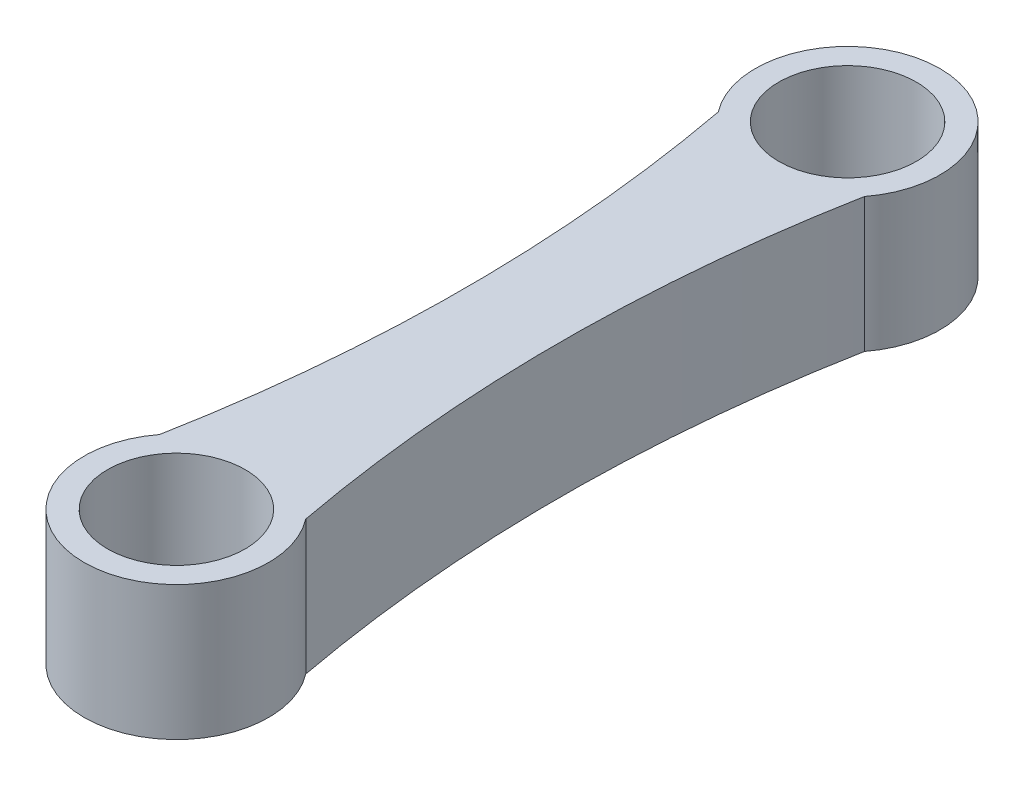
ISO-10303-21;
HEADER;
FILE_DESCRIPTION(('STEP AP214'),'2;1');
FILE_NAME('part.step','',(''),(''),'','','');
FILE_SCHEMA(('AUTOMOTIVE_DESIGN { 1 0 10303 214 1 1 1 1 }'));
ENDSEC;
DATA;
#1=APPLICATION_CONTEXT('core data for automotive mechanical design processes');
#2=APPLICATION_PROTOCOL_DEFINITION('international standard','automotive_design',2000,#1);
#3=PRODUCT_CONTEXT('',#1,'mechanical');
#4=PRODUCT('Part','Part','',(#3));
#5=PRODUCT_RELATED_PRODUCT_CATEGORY('part','',(#4));
#6=PRODUCT_DEFINITION_FORMATION('','',#4);
#7=PRODUCT_DEFINITION_CONTEXT('part definition',#1,'design');
#8=PRODUCT_DEFINITION('design','',#6,#7);
#9=PRODUCT_DEFINITION_SHAPE('','',#8);
#10=(LENGTH_UNIT() NAMED_UNIT(*) SI_UNIT(.MILLI.,.METRE.));
#11=(NAMED_UNIT(*) PLANE_ANGLE_UNIT() SI_UNIT($,.RADIAN.));
#12=(NAMED_UNIT(*) SI_UNIT($,.STERADIAN.) SOLID_ANGLE_UNIT());
#13=UNCERTAINTY_MEASURE_WITH_UNIT(LENGTH_MEASURE(1.E-05),#10,'distance_accuracy_value','');
#14=(GEOMETRIC_REPRESENTATION_CONTEXT(3) GLOBAL_UNCERTAINTY_ASSIGNED_CONTEXT((#13)) GLOBAL_UNIT_ASSIGNED_CONTEXT((#10,
#11,#12)) REPRESENTATION_CONTEXT('',''));
#15=CARTESIAN_POINT('',(0.,0.,0.));
#16=DIRECTION('',(0.,0.,1.));
#17=DIRECTION('',(1.,0.,0.));
#18=AXIS2_PLACEMENT_3D('',#15,#16,#17);
#19=CARTESIAN_POINT('',(0.,8.,16.8173598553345));
#20=DIRECTION('',(0.,-1.,0.));
#21=DIRECTION('',(0.,0.,-1.));
#22=AXIS2_PLACEMENT_3D('',#19,#20,#21);
#23=CYLINDRICAL_SURFACE('',#22,5.5);
#24=CARTESIAN_POINT('',(0.,0.,16.8173598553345));
#25=DIRECTION('',(0.,1.,0.));
#26=DIRECTION('',(0.,0.,1.));
#27=AXIS2_PLACEMENT_3D('',#24,#25,#26);
#28=CIRCLE('',#27,5.5);
#29=CARTESIAN_POINT('',(-4.35925472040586,0.,13.4637202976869));
#30=VERTEX_POINT('',#29);
#31=CARTESIAN_POINT('',(4.35925472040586,0.,13.4637202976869));
#32=VERTEX_POINT('',#31);
#33=EDGE_CURVE('E113',#30,#32,#28,.T.);
#34=ORIENTED_EDGE('',*,*,#33,.T.);
#35=DIRECTION('',(0.,-1.,0.));
#36=VECTOR('',#35,1.);
#37=CARTESIAN_POINT('',(4.35925472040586,8.,13.4637202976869));
#38=LINE('',#37,#36);
#39=CARTESIAN_POINT('',(4.35925472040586,8.,13.4637202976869));
#40=VERTEX_POINT('',#39);
#41=EDGE_CURVE('E95',#40,#32,#38,.T.);
#42=ORIENTED_EDGE('',*,*,#41,.F.);
#43=CARTESIAN_POINT('',(0.,8.,16.8173598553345));
#44=DIRECTION('',(0.,1.,0.));
#45=DIRECTION('',(0.,0.,1.));
#46=AXIS2_PLACEMENT_3D('',#43,#44,#45);
#47=CIRCLE('',#46,5.5);
#48=CARTESIAN_POINT('',(-4.35925472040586,8.,13.4637202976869));
#49=VERTEX_POINT('',#48);
#50=EDGE_CURVE('E83',#49,#40,#47,.T.);
#51=ORIENTED_EDGE('',*,*,#50,.F.);
#52=DIRECTION('',(0.,-1.,0.));
#53=VECTOR('',#52,1.);
#54=CARTESIAN_POINT('',(-4.35925472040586,8.,13.4637202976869));
#55=LINE('',#54,#53);
#56=EDGE_CURVE('E112',#49,#30,#55,.T.);
#57=ORIENTED_EDGE('',*,*,#56,.T.);
#58=EDGE_LOOP('',(#34,#42,#51,#57));
#59=FACE_BOUND('',#58,.T.);
#60=ADVANCED_FACE('F39',(#59),#23,.T.);
#61=CARTESIAN_POINT('',(92.9881676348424,8.,-3.18264014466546));
#62=DIRECTION('',(0.,-1.,0.));
#63=DIRECTION('',(0.,0.,-1.));
#64=AXIS2_PLACEMENT_3D('',#61,#62,#63);
#65=CYLINDRICAL_SURFACE('',#64,90.1786311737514);
#66=CARTESIAN_POINT('',(92.9881676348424,0.,-3.18264014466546));
#67=DIRECTION('',(0.,1.,0.));
#68=DIRECTION('',(0.,0.,1.));
#69=AXIS2_PLACEMENT_3D('',#66,#67,#68);
#70=CIRCLE('',#69,90.1786311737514);
#71=CARTESIAN_POINT('',(4.35925472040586,0.,-19.8290005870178));
#72=VERTEX_POINT('',#71);
#73=EDGE_CURVE('E94',#72,#32,#70,.T.);
#74=ORIENTED_EDGE('',*,*,#73,.F.);
#75=DIRECTION('',(0.,-1.,0.));
#76=VECTOR('',#75,1.);
#77=CARTESIAN_POINT('',(4.35925472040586,8.,-19.8290005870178));
#78=LINE('',#77,#76);
#79=CARTESIAN_POINT('',(4.35925472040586,8.,-19.8290005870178));
#80=VERTEX_POINT('',#79);
#81=EDGE_CURVE('E89',#80,#72,#78,.T.);
#82=ORIENTED_EDGE('',*,*,#81,.F.);
#83=CARTESIAN_POINT('',(92.9881676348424,8.,-3.18264014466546));
#84=DIRECTION('',(0.,1.,0.));
#85=DIRECTION('',(0.,0.,1.));
#86=AXIS2_PLACEMENT_3D('',#83,#84,#85);
#87=CIRCLE('',#86,90.1786311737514);
#88=EDGE_CURVE('E92',#80,#40,#87,.T.);
#89=ORIENTED_EDGE('',*,*,#88,.T.);
#90=ORIENTED_EDGE('',*,*,#41,.T.);
#91=EDGE_LOOP('',(#74,#82,#89,#90));
#92=FACE_BOUND('',#91,.T.);
#93=ADVANCED_FACE('F91',(#92),#65,.F.);
#94=CARTESIAN_POINT('',(0.,8.,-23.1826401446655));
#95=DIRECTION('',(0.,-1.,0.));
#96=DIRECTION('',(0.,0.,-1.));
#97=AXIS2_PLACEMENT_3D('',#94,#95,#96);
#98=CYLINDRICAL_SURFACE('',#97,5.5);
#99=CARTESIAN_POINT('',(0.,0.,-23.1826401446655));
#100=DIRECTION('',(0.,1.,0.));
#101=DIRECTION('',(0.,0.,1.));
#102=AXIS2_PLACEMENT_3D('',#99,#100,#101);
#103=CIRCLE('',#102,5.5);
#104=CARTESIAN_POINT('',(-4.35925472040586,0.,-19.8290005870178));
#105=VERTEX_POINT('',#104);
#106=EDGE_CURVE('E72',#72,#105,#103,.T.);
#107=ORIENTED_EDGE('',*,*,#106,.T.);
#108=DIRECTION('',(0.,-1.,0.));
#109=VECTOR('',#108,1.);
#110=CARTESIAN_POINT('',(-4.35925472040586,8.,-19.8290005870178));
#111=LINE('',#110,#109);
#112=CARTESIAN_POINT('',(-4.35925472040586,8.,-19.8290005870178));
#113=VERTEX_POINT('',#112);
#114=EDGE_CURVE('E96',#113,#105,#111,.T.);
#115=ORIENTED_EDGE('',*,*,#114,.F.);
#116=CARTESIAN_POINT('',(0.,8.,-23.1826401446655));
#117=DIRECTION('',(0.,1.,0.));
#118=DIRECTION('',(0.,0.,1.));
#119=AXIS2_PLACEMENT_3D('',#116,#117,#118);
#120=CIRCLE('',#119,5.5);
#121=EDGE_CURVE('E98',#80,#113,#120,.T.);
#122=ORIENTED_EDGE('',*,*,#121,.F.);
#123=ORIENTED_EDGE('',*,*,#81,.T.);
#124=EDGE_LOOP('',(#107,#115,#122,#123));
#125=FACE_BOUND('',#124,.T.);
#126=ADVANCED_FACE('F99',(#125),#98,.T.);
#127=CARTESIAN_POINT('',(-92.9881676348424,8.,-3.18264014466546));
#128=DIRECTION('',(0.,-1.,0.));
#129=DIRECTION('',(0.,0.,-1.));
#130=AXIS2_PLACEMENT_3D('',#127,#128,#129);
#131=CYLINDRICAL_SURFACE('',#130,90.1786311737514);
#132=CARTESIAN_POINT('',(-92.9881676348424,0.,-3.18264014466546));
#133=DIRECTION('',(0.,1.,0.));
#134=DIRECTION('',(0.,0.,1.));
#135=AXIS2_PLACEMENT_3D('',#132,#133,#134);
#136=CIRCLE('',#135,90.1786311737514);
#137=EDGE_CURVE('E78',#105,#30,#136,.F.);
#138=ORIENTED_EDGE('',*,*,#137,.T.);
#139=ORIENTED_EDGE('',*,*,#56,.F.);
#140=CARTESIAN_POINT('',(-92.9881676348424,8.,-3.18264014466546));
#141=DIRECTION('',(0.,1.,0.));
#142=DIRECTION('',(0.,0.,1.));
#143=AXIS2_PLACEMENT_3D('',#140,#141,#142);
#144=CIRCLE('',#143,90.1786311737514);
#145=EDGE_CURVE('E56',#113,#49,#144,.F.);
#146=ORIENTED_EDGE('',*,*,#145,.F.);
#147=ORIENTED_EDGE('',*,*,#114,.T.);
#148=EDGE_LOOP('',(#138,#139,#146,#147));
#149=FACE_BOUND('',#148,.T.);
#150=ADVANCED_FACE('F154',(#149),#131,.F.);
#151=CARTESIAN_POINT('',(0.,8.,16.8173598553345));
#152=DIRECTION('',(0.,-1.,0.));
#153=DIRECTION('',(0.,0.,-1.));
#154=AXIS2_PLACEMENT_3D('',#151,#152,#153);
#155=CYLINDRICAL_SURFACE('',#154,4.1);
#156=CARTESIAN_POINT('',(0.,2.,16.8173598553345));
#157=DIRECTION('',(0.,1.,0.));
#158=DIRECTION('',(0.,0.,1.));
#159=AXIS2_PLACEMENT_3D('',#156,#157,#158);
#160=CIRCLE('',#159,4.1);
#161=CARTESIAN_POINT('',(0.,2.,20.9173598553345));
#162=VERTEX_POINT('',#161);
#163=EDGE_CURVE('E11',#162,#162,#160,.T.);
#164=ORIENTED_EDGE('',*,*,#163,.F.);
#165=EDGE_LOOP('',(#164));
#166=FACE_BOUND('',#165,.T.);
#167=CARTESIAN_POINT('',(0.,8.,16.8173598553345));
#168=DIRECTION('',(0.,1.,0.));
#169=DIRECTION('',(0.,0.,1.));
#170=AXIS2_PLACEMENT_3D('',#167,#168,#169);
#171=CIRCLE('',#170,4.1);
#172=CARTESIAN_POINT('',(0.,8.,20.9173598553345));
#173=VERTEX_POINT('',#172);
#174=EDGE_CURVE('E104',#173,#173,#171,.T.);
#175=ORIENTED_EDGE('',*,*,#174,.T.);
#176=EDGE_LOOP('',(#175));
#177=FACE_BOUND('',#176,.T.);
#178=ADVANCED_FACE('F41',(#166,#177),#155,.F.);
#179=CARTESIAN_POINT('',(0.,8.,-23.1826401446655));
#180=DIRECTION('',(0.,-1.,0.));
#181=DIRECTION('',(0.,0.,-1.));
#182=AXIS2_PLACEMENT_3D('',#179,#180,#181);
#183=CYLINDRICAL_SURFACE('',#182,4.1);
#184=CARTESIAN_POINT('',(0.,2.,-23.1826401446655));
#185=DIRECTION('',(0.,1.,0.));
#186=DIRECTION('',(0.,0.,1.));
#187=AXIS2_PLACEMENT_3D('',#184,#185,#186);
#188=CIRCLE('',#187,4.1);
#189=CARTESIAN_POINT('',(0.,2.,-19.0826401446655));
#190=VERTEX_POINT('',#189);
#191=EDGE_CURVE('E48',#190,#190,#188,.T.);
#192=ORIENTED_EDGE('',*,*,#191,.F.);
#193=EDGE_LOOP('',(#192));
#194=FACE_BOUND('',#193,.T.);
#195=CARTESIAN_POINT('',(0.,8.,-23.1826401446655));
#196=DIRECTION('',(0.,1.,0.));
#197=DIRECTION('',(0.,0.,1.));
#198=AXIS2_PLACEMENT_3D('',#195,#196,#197);
#199=CIRCLE('',#198,4.1);
#200=CARTESIAN_POINT('',(0.,8.,-19.0826401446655));
#201=VERTEX_POINT('',#200);
#202=EDGE_CURVE('E109',#201,#201,#199,.T.);
#203=ORIENTED_EDGE('',*,*,#202,.T.);
#204=EDGE_LOOP('',(#203));
#205=FACE_BOUND('',#204,.T.);
#206=ADVANCED_FACE('F128',(#194,#205),#183,.F.);
#207=CARTESIAN_POINT('',(0.,8.,0.));
#208=DIRECTION('',(0.,1.,0.));
#209=DIRECTION('',(0.,0.,1.));
#210=AXIS2_PLACEMENT_3D('',#207,#208,#209);
#211=PLANE('',#210);
#212=ORIENTED_EDGE('',*,*,#174,.F.);
#213=EDGE_LOOP('',(#212));
#214=FACE_BOUND('',#213,.T.);
#215=ORIENTED_EDGE('',*,*,#50,.T.);
#216=ORIENTED_EDGE('',*,*,#88,.F.);
#217=ORIENTED_EDGE('',*,*,#121,.T.);
#218=ORIENTED_EDGE('',*,*,#145,.T.);
#219=EDGE_LOOP('',(#215,#216,#217,#218));
#220=FACE_BOUND('',#219,.T.);
#221=ORIENTED_EDGE('',*,*,#202,.F.);
#222=EDGE_LOOP('',(#221));
#223=FACE_BOUND('',#222,.T.);
#224=ADVANCED_FACE('F101',(#214,#220,#223),#211,.T.);
#225=CARTESIAN_POINT('',(0.,0.,0.));
#226=DIRECTION('',(0.,1.,0.));
#227=DIRECTION('',(0.,0.,1.));
#228=AXIS2_PLACEMENT_3D('',#225,#226,#227);
#229=PLANE('',#228);
#230=ORIENTED_EDGE('',*,*,#33,.F.);
#231=ORIENTED_EDGE('',*,*,#137,.F.);
#232=ORIENTED_EDGE('',*,*,#106,.F.);
#233=ORIENTED_EDGE('',*,*,#73,.T.);
#234=EDGE_LOOP('',(#230,#231,#232,#233));
#235=FACE_BOUND('',#234,.T.);
#236=CARTESIAN_POINT('',(0.,0.,-23.1826401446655));
#237=DIRECTION('',(0.,1.,0.));
#238=DIRECTION('',(0.,0.,1.));
#239=AXIS2_PLACEMENT_3D('',#236,#237,#238);
#240=CIRCLE('',#239,2.);
#241=CARTESIAN_POINT('',(0.,0.,-21.1826401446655));
#242=VERTEX_POINT('',#241);
#243=EDGE_CURVE('E166',#242,#242,#240,.T.);
#244=ORIENTED_EDGE('',*,*,#243,.T.);
#245=EDGE_LOOP('',(#244));
#246=FACE_BOUND('',#245,.T.);
#247=CARTESIAN_POINT('',(0.,0.,16.8173598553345));
#248=DIRECTION('',(0.,1.,0.));
#249=DIRECTION('',(0.,0.,1.));
#250=AXIS2_PLACEMENT_3D('',#247,#248,#249);
#251=CIRCLE('',#250,2.);
#252=CARTESIAN_POINT('',(0.,0.,18.8173598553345));
#253=VERTEX_POINT('',#252);
#254=EDGE_CURVE('E172',#253,#253,#251,.T.);
#255=ORIENTED_EDGE('',*,*,#254,.T.);
#256=EDGE_LOOP('',(#255));
#257=FACE_BOUND('',#256,.T.);
#258=ADVANCED_FACE('F134',(#235,#246,#257),#229,.F.);
#259=CARTESIAN_POINT('',(0.,2.,-23.1826401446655));
#260=DIRECTION('',(0.,-1.,0.));
#261=DIRECTION('',(0.,0.,-1.));
#262=AXIS2_PLACEMENT_3D('',#259,#260,#261);
#263=CYLINDRICAL_SURFACE('',#262,2.);
#264=CARTESIAN_POINT('',(0.,2.,-23.1826401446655));
#265=DIRECTION('',(0.,1.,0.));
#266=DIRECTION('',(0.,0.,1.));
#267=AXIS2_PLACEMENT_3D('',#264,#265,#266);
#268=CIRCLE('',#267,2.);
#269=CARTESIAN_POINT('',(0.,2.,-21.1826401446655));
#270=VERTEX_POINT('',#269);
#271=EDGE_CURVE('E116',#270,#270,#268,.T.);
#272=ORIENTED_EDGE('',*,*,#271,.T.);
#273=EDGE_LOOP('',(#272));
#274=FACE_BOUND('',#273,.T.);
#275=ORIENTED_EDGE('',*,*,#243,.F.);
#276=EDGE_LOOP('',(#275));
#277=FACE_BOUND('',#276,.T.);
#278=ADVANCED_FACE('F140',(#274,#277),#263,.F.);
#279=CARTESIAN_POINT('',(0.,2.,0.));
#280=DIRECTION('',(0.,1.,0.));
#281=DIRECTION('',(0.,0.,1.));
#282=AXIS2_PLACEMENT_3D('',#279,#280,#281);
#283=PLANE('',#282);
#284=ORIENTED_EDGE('',*,*,#191,.T.);
#285=EDGE_LOOP('',(#284));
#286=FACE_BOUND('',#285,.T.);
#287=ORIENTED_EDGE('',*,*,#271,.F.);
#288=EDGE_LOOP('',(#287));
#289=FACE_BOUND('',#288,.T.);
#290=ADVANCED_FACE('F125',(#286,#289),#283,.T.);
#291=CARTESIAN_POINT('',(0.,2.,16.8173598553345));
#292=DIRECTION('',(0.,-1.,0.));
#293=DIRECTION('',(0.,0.,-1.));
#294=AXIS2_PLACEMENT_3D('',#291,#292,#293);
#295=CYLINDRICAL_SURFACE('',#294,2.);
#296=CARTESIAN_POINT('',(0.,2.,16.8173598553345));
#297=DIRECTION('',(0.,1.,0.));
#298=DIRECTION('',(0.,0.,1.));
#299=AXIS2_PLACEMENT_3D('',#296,#297,#298);
#300=CIRCLE('',#299,2.);
#301=CARTESIAN_POINT('',(0.,2.,18.8173598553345));
#302=VERTEX_POINT('',#301);
#303=EDGE_CURVE('E169',#302,#302,#300,.T.);
#304=ORIENTED_EDGE('',*,*,#303,.T.);
#305=EDGE_LOOP('',(#304));
#306=FACE_BOUND('',#305,.T.);
#307=ORIENTED_EDGE('',*,*,#254,.F.);
#308=EDGE_LOOP('',(#307));
#309=FACE_BOUND('',#308,.T.);
#310=ADVANCED_FACE('F178',(#306,#309),#295,.F.);
#311=CARTESIAN_POINT('',(0.,2.,0.));
#312=DIRECTION('',(0.,1.,0.));
#313=DIRECTION('',(0.,0.,1.));
#314=AXIS2_PLACEMENT_3D('',#311,#312,#313);
#315=PLANE('',#314);
#316=ORIENTED_EDGE('',*,*,#163,.T.);
#317=EDGE_LOOP('',(#316));
#318=FACE_BOUND('',#317,.T.);
#319=ORIENTED_EDGE('',*,*,#303,.F.);
#320=EDGE_LOOP('',(#319));
#321=FACE_BOUND('',#320,.T.);
#322=ADVANCED_FACE('F181',(#318,#321),#315,.T.);
#323=CLOSED_SHELL('',(#60,#93,#126,#150,#178,#206,#224,#258,#278,#290,#310,#322));
#324=MANIFOLD_SOLID_BREP('B2',#323);
#325=ADVANCED_BREP_SHAPE_REPRESENTATION('',(#18,#324),#14);
#326=SHAPE_DEFINITION_REPRESENTATION(#9,#325);
ENDSEC;
END-ISO-10303-21;
